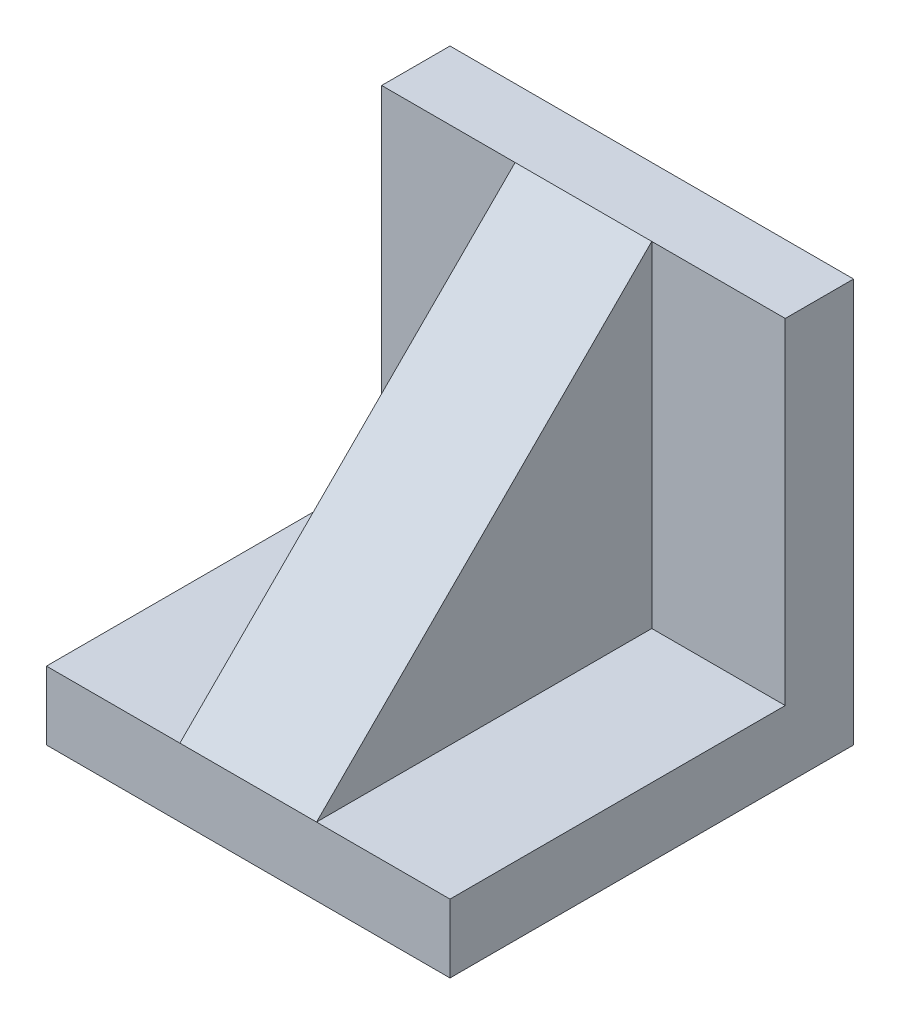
ISO-10303-21;
HEADER;
FILE_DESCRIPTION(('STEP AP214'),'2;1');
FILE_NAME('part.step','',(''),(''),'','','');
FILE_SCHEMA(('AUTOMOTIVE_DESIGN { 1 0 10303 214 1 1 1 1 }'));
ENDSEC;
DATA;
#1=APPLICATION_CONTEXT('core data for automotive mechanical design processes');
#2=APPLICATION_PROTOCOL_DEFINITION('international standard','automotive_design',2000,#1);
#3=PRODUCT_CONTEXT('',#1,'mechanical');
#4=PRODUCT('Part','Part','',(#3));
#5=PRODUCT_RELATED_PRODUCT_CATEGORY('part','',(#4));
#6=PRODUCT_DEFINITION_FORMATION('','',#4);
#7=PRODUCT_DEFINITION_CONTEXT('part definition',#1,'design');
#8=PRODUCT_DEFINITION('design','',#6,#7);
#9=PRODUCT_DEFINITION_SHAPE('','',#8);
#10=(LENGTH_UNIT() NAMED_UNIT(*) SI_UNIT(.MILLI.,.METRE.));
#11=(NAMED_UNIT(*) PLANE_ANGLE_UNIT() SI_UNIT($,.RADIAN.));
#12=(NAMED_UNIT(*) SI_UNIT($,.STERADIAN.) SOLID_ANGLE_UNIT());
#13=UNCERTAINTY_MEASURE_WITH_UNIT(LENGTH_MEASURE(1.E-05),#10,'distance_accuracy_value','');
#14=(GEOMETRIC_REPRESENTATION_CONTEXT(3) GLOBAL_UNCERTAINTY_ASSIGNED_CONTEXT((#13)) GLOBAL_UNIT_ASSIGNED_CONTEXT((#10,
#11,#12)) REPRESENTATION_CONTEXT('',''));
#15=CARTESIAN_POINT('',(0.,0.,0.));
#16=DIRECTION('',(0.,0.,1.));
#17=DIRECTION('',(1.,0.,0.));
#18=AXIS2_PLACEMENT_3D('',#15,#16,#17);
#19=CARTESIAN_POINT('',(-75.,25.4,150.));
#20=DIRECTION('',(0.,-1.,0.));
#21=DIRECTION('',(0.,0.,-1.));
#22=AXIS2_PLACEMENT_3D('',#19,#20,#21);
#23=PLANE('',#22);
#24=DIRECTION('',(0.,0.,-1.));
#25=VECTOR('',#24,1.);
#26=CARTESIAN_POINT('',(25.4,25.4,150.));
#27=LINE('',#26,#25);
#28=CARTESIAN_POINT('',(25.4,25.4,150.));
#29=VERTEX_POINT('',#28);
#30=CARTESIAN_POINT('',(25.4,25.4,25.4));
#31=VERTEX_POINT('',#30);
#32=EDGE_CURVE('E131',#29,#31,#27,.T.);
#33=ORIENTED_EDGE('',*,*,#32,.F.);
#34=DIRECTION('',(1.,0.,0.));
#35=VECTOR('',#34,1.);
#36=CARTESIAN_POINT('',(-75.,25.4,150.));
#37=LINE('',#36,#35);
#38=CARTESIAN_POINT('',(75.,25.4,150.));
#39=VERTEX_POINT('',#38);
#40=EDGE_CURVE('E55',#29,#39,#37,.T.);
#41=ORIENTED_EDGE('',*,*,#40,.T.);
#42=DIRECTION('',(0.,0.,-1.));
#43=VECTOR('',#42,1.);
#44=CARTESIAN_POINT('',(75.,25.4,150.));
#45=LINE('',#44,#43);
#46=CARTESIAN_POINT('',(75.,25.4,25.4));
#47=VERTEX_POINT('',#46);
#48=EDGE_CURVE('E186',#39,#47,#45,.T.);
#49=ORIENTED_EDGE('',*,*,#48,.T.);
#50=DIRECTION('',(1.,0.,0.));
#51=VECTOR('',#50,1.);
#52=CARTESIAN_POINT('',(-75.,25.4,25.4));
#53=LINE('',#52,#51);
#54=EDGE_CURVE('E139',#31,#47,#53,.T.);
#55=ORIENTED_EDGE('',*,*,#54,.F.);
#56=EDGE_LOOP('',(#33,#41,#49,#55));
#57=FACE_BOUND('',#56,.T.);
#58=ADVANCED_FACE('F47',(#57),#23,.F.);
#59=CARTESIAN_POINT('',(-75.,25.4,25.4));
#60=DIRECTION('',(0.,0.,-1.));
#61=DIRECTION('',(-1.,0.,0.));
#62=AXIS2_PLACEMENT_3D('',#59,#60,#61);
#63=PLANE('',#62);
#64=DIRECTION('',(0.,1.,0.));
#65=VECTOR('',#64,1.);
#66=CARTESIAN_POINT('',(25.4,25.4,25.4));
#67=LINE('',#66,#65);
#68=CARTESIAN_POINT('',(25.4,150.,25.4));
#69=VERTEX_POINT('',#68);
#70=EDGE_CURVE('E125',#31,#69,#67,.T.);
#71=ORIENTED_EDGE('',*,*,#70,.F.);
#72=ORIENTED_EDGE('',*,*,#54,.T.);
#73=DIRECTION('',(0.,1.,0.));
#74=VECTOR('',#73,1.);
#75=CARTESIAN_POINT('',(75.,25.4,25.4));
#76=LINE('',#75,#74);
#77=CARTESIAN_POINT('',(75.,150.,25.4));
#78=VERTEX_POINT('',#77);
#79=EDGE_CURVE('E183',#47,#78,#76,.T.);
#80=ORIENTED_EDGE('',*,*,#79,.T.);
#81=DIRECTION('',(1.,0.,0.));
#82=VECTOR('',#81,1.);
#83=CARTESIAN_POINT('',(-75.,150.,25.4));
#84=LINE('',#83,#82);
#85=EDGE_CURVE('E156',#69,#78,#84,.T.);
#86=ORIENTED_EDGE('',*,*,#85,.F.);
#87=EDGE_LOOP('',(#71,#72,#80,#86));
#88=FACE_BOUND('',#87,.T.);
#89=ADVANCED_FACE('F222',(#88),#63,.F.);
#90=CARTESIAN_POINT('',(-75.,0.,150.));
#91=DIRECTION('',(0.,0.,-1.));
#92=DIRECTION('',(-1.,0.,0.));
#93=AXIS2_PLACEMENT_3D('',#90,#91,#92);
#94=PLANE('',#93);
#95=DIRECTION('',(1.,0.,0.));
#96=VECTOR('',#95,1.);
#97=CARTESIAN_POINT('',(-75.,0.,150.));
#98=LINE('',#97,#96);
#99=CARTESIAN_POINT('',(-75.,0.,150.));
#100=VERTEX_POINT('',#99);
#101=CARTESIAN_POINT('',(75.,0.,150.));
#102=VERTEX_POINT('',#101);
#103=EDGE_CURVE('E161',#100,#102,#98,.T.);
#104=ORIENTED_EDGE('',*,*,#103,.T.);
#105=DIRECTION('',(0.,1.,0.));
#106=VECTOR('',#105,1.);
#107=CARTESIAN_POINT('',(75.,0.,150.));
#108=LINE('',#107,#106);
#109=EDGE_CURVE('E145',#102,#39,#108,.T.);
#110=ORIENTED_EDGE('',*,*,#109,.T.);
#111=ORIENTED_EDGE('',*,*,#40,.F.);
#112=DIRECTION('',(1.,0.,0.));
#113=VECTOR('',#112,1.);
#114=CARTESIAN_POINT('',(-25.4,25.4,150.));
#115=LINE('',#114,#113);
#116=CARTESIAN_POINT('',(-25.4,25.4,150.));
#117=VERTEX_POINT('',#116);
#118=EDGE_CURVE('E118',#117,#29,#115,.T.);
#119=ORIENTED_EDGE('',*,*,#118,.F.);
#120=CARTESIAN_POINT('',(-75.,25.4,150.));
#121=VERTEX_POINT('',#120);
#122=EDGE_CURVE('E11',#121,#117,#37,.T.);
#123=ORIENTED_EDGE('',*,*,#122,.F.);
#124=DIRECTION('',(0.,1.,0.));
#125=VECTOR('',#124,1.);
#126=CARTESIAN_POINT('',(-75.,0.,150.));
#127=LINE('',#126,#125);
#128=EDGE_CURVE('E172',#100,#121,#127,.T.);
#129=ORIENTED_EDGE('',*,*,#128,.F.);
#130=EDGE_LOOP('',(#104,#110,#111,#119,#123,#129));
#131=FACE_BOUND('',#130,.T.);
#132=ADVANCED_FACE('F49',(#131),#94,.F.);
#133=ORIENTED_EDGE('',*,*,#122,.T.);
#134=DIRECTION('',(0.,0.,-1.));
#135=VECTOR('',#134,1.);
#136=CARTESIAN_POINT('',(-25.4,25.4,150.));
#137=LINE('',#136,#135);
#138=CARTESIAN_POINT('',(-25.4,25.4,25.4));
#139=VERTEX_POINT('',#138);
#140=EDGE_CURVE('E189',#117,#139,#137,.T.);
#141=ORIENTED_EDGE('',*,*,#140,.T.);
#142=CARTESIAN_POINT('',(-75.,25.4,25.4));
#143=VERTEX_POINT('',#142);
#144=EDGE_CURVE('E146',#143,#139,#53,.T.);
#145=ORIENTED_EDGE('',*,*,#144,.F.);
#146=DIRECTION('',(0.,0.,-1.));
#147=VECTOR('',#146,1.);
#148=CARTESIAN_POINT('',(-75.,25.4,150.));
#149=LINE('',#148,#147);
#150=EDGE_CURVE('E170',#121,#143,#149,.T.);
#151=ORIENTED_EDGE('',*,*,#150,.F.);
#152=EDGE_LOOP('',(#133,#141,#145,#151));
#153=FACE_BOUND('',#152,.T.);
#154=ADVANCED_FACE('F211',(#153),#23,.F.);
#155=ORIENTED_EDGE('',*,*,#144,.T.);
#156=DIRECTION('',(0.,1.,0.));
#157=VECTOR('',#156,1.);
#158=CARTESIAN_POINT('',(-25.4,25.4,25.4));
#159=LINE('',#158,#157);
#160=CARTESIAN_POINT('',(-25.4,150.,25.4));
#161=VERTEX_POINT('',#160);
#162=EDGE_CURVE('E141',#139,#161,#159,.T.);
#163=ORIENTED_EDGE('',*,*,#162,.T.);
#164=CARTESIAN_POINT('',(-75.,150.,25.4));
#165=VERTEX_POINT('',#164);
#166=EDGE_CURVE('E152',#165,#161,#84,.T.);
#167=ORIENTED_EDGE('',*,*,#166,.F.);
#168=DIRECTION('',(0.,1.,0.));
#169=VECTOR('',#168,1.);
#170=CARTESIAN_POINT('',(-75.,25.4,25.4));
#171=LINE('',#170,#169);
#172=EDGE_CURVE('E168',#143,#165,#171,.T.);
#173=ORIENTED_EDGE('',*,*,#172,.F.);
#174=EDGE_LOOP('',(#155,#163,#167,#173));
#175=FACE_BOUND('',#174,.T.);
#176=ADVANCED_FACE('F204',(#175),#63,.F.);
#177=CARTESIAN_POINT('',(-75.,150.,25.4));
#178=DIRECTION('',(0.,-1.,0.));
#179=DIRECTION('',(0.,0.,-1.));
#180=AXIS2_PLACEMENT_3D('',#177,#178,#179);
#181=PLANE('',#180);
#182=ORIENTED_EDGE('',*,*,#166,.T.);
#183=DIRECTION('',(1.,0.,0.));
#184=VECTOR('',#183,1.);
#185=CARTESIAN_POINT('',(-25.4,150.,25.4));
#186=LINE('',#185,#184);
#187=EDGE_CURVE('E126',#161,#69,#186,.T.);
#188=ORIENTED_EDGE('',*,*,#187,.T.);
#189=ORIENTED_EDGE('',*,*,#85,.T.);
#190=DIRECTION('',(0.,0.,-1.));
#191=VECTOR('',#190,1.);
#192=CARTESIAN_POINT('',(75.,150.,25.4));
#193=LINE('',#192,#191);
#194=CARTESIAN_POINT('',(75.,150.,0.));
#195=VERTEX_POINT('',#194);
#196=EDGE_CURVE('E180',#78,#195,#193,.T.);
#197=ORIENTED_EDGE('',*,*,#196,.T.);
#198=DIRECTION('',(1.,0.,0.));
#199=VECTOR('',#198,1.);
#200=CARTESIAN_POINT('',(-75.,150.,0.));
#201=LINE('',#200,#199);
#202=CARTESIAN_POINT('',(-75.,150.,0.));
#203=VERTEX_POINT('',#202);
#204=EDGE_CURVE('E157',#203,#195,#201,.T.);
#205=ORIENTED_EDGE('',*,*,#204,.F.);
#206=DIRECTION('',(0.,0.,-1.));
#207=VECTOR('',#206,1.);
#208=CARTESIAN_POINT('',(-75.,150.,25.4));
#209=LINE('',#208,#207);
#210=EDGE_CURVE('E166',#165,#203,#209,.T.);
#211=ORIENTED_EDGE('',*,*,#210,.F.);
#212=EDGE_LOOP('',(#182,#188,#189,#197,#205,#211));
#213=FACE_BOUND('',#212,.T.);
#214=ADVANCED_FACE('F198',(#213),#181,.F.);
#215=CARTESIAN_POINT('',(-75.,150.,0.));
#216=DIRECTION('',(0.,0.,1.));
#217=DIRECTION('',(0.,-1.,0.));
#218=AXIS2_PLACEMENT_3D('',#215,#216,#217);
#219=PLANE('',#218);
#220=ORIENTED_EDGE('',*,*,#204,.T.);
#221=DIRECTION('',(0.,-1.,0.));
#222=VECTOR('',#221,1.);
#223=CARTESIAN_POINT('',(75.,150.,0.));
#224=LINE('',#223,#222);
#225=CARTESIAN_POINT('',(75.,0.,0.));
#226=VERTEX_POINT('',#225);
#227=EDGE_CURVE('E177',#195,#226,#224,.T.);
#228=ORIENTED_EDGE('',*,*,#227,.T.);
#229=DIRECTION('',(1.,0.,0.));
#230=VECTOR('',#229,1.);
#231=CARTESIAN_POINT('',(-75.,0.,0.));
#232=LINE('',#231,#230);
#233=CARTESIAN_POINT('',(-75.,0.,0.));
#234=VERTEX_POINT('',#233);
#235=EDGE_CURVE('E159',#234,#226,#232,.T.);
#236=ORIENTED_EDGE('',*,*,#235,.F.);
#237=DIRECTION('',(0.,-1.,0.));
#238=VECTOR('',#237,1.);
#239=CARTESIAN_POINT('',(-75.,150.,0.));
#240=LINE('',#239,#238);
#241=EDGE_CURVE('E164',#203,#234,#240,.T.);
#242=ORIENTED_EDGE('',*,*,#241,.F.);
#243=EDGE_LOOP('',(#220,#228,#236,#242));
#244=FACE_BOUND('',#243,.T.);
#245=ADVANCED_FACE('F220',(#244),#219,.F.);
#246=CARTESIAN_POINT('',(-75.,0.,0.));
#247=DIRECTION('',(0.,1.,0.));
#248=DIRECTION('',(0.,0.,1.));
#249=AXIS2_PLACEMENT_3D('',#246,#247,#248);
#250=PLANE('',#249);
#251=ORIENTED_EDGE('',*,*,#235,.T.);
#252=DIRECTION('',(0.,0.,1.));
#253=VECTOR('',#252,1.);
#254=CARTESIAN_POINT('',(75.,0.,0.));
#255=LINE('',#254,#253);
#256=EDGE_CURVE('E174',#226,#102,#255,.T.);
#257=ORIENTED_EDGE('',*,*,#256,.T.);
#258=ORIENTED_EDGE('',*,*,#103,.F.);
#259=DIRECTION('',(0.,0.,1.));
#260=VECTOR('',#259,1.);
#261=CARTESIAN_POINT('',(-75.,0.,0.));
#262=LINE('',#261,#260);
#263=EDGE_CURVE('E70',#234,#100,#262,.T.);
#264=ORIENTED_EDGE('',*,*,#263,.F.);
#265=EDGE_LOOP('',(#251,#257,#258,#264));
#266=FACE_BOUND('',#265,.T.);
#267=ADVANCED_FACE('F218',(#266),#250,.F.);
#268=CARTESIAN_POINT('',(-75.,0.,0.));
#269=DIRECTION('',(-1.,0.,0.));
#270=DIRECTION('',(0.,0.,1.));
#271=AXIS2_PLACEMENT_3D('',#268,#269,#270);
#272=PLANE('',#271);
#273=ORIENTED_EDGE('',*,*,#128,.T.);
#274=ORIENTED_EDGE('',*,*,#150,.T.);
#275=ORIENTED_EDGE('',*,*,#172,.T.);
#276=ORIENTED_EDGE('',*,*,#210,.T.);
#277=ORIENTED_EDGE('',*,*,#241,.T.);
#278=ORIENTED_EDGE('',*,*,#263,.T.);
#279=EDGE_LOOP('',(#273,#274,#275,#276,#277,#278));
#280=FACE_BOUND('',#279,.T.);
#281=ADVANCED_FACE('F207',(#280),#272,.T.);
#282=CARTESIAN_POINT('',(75.,0.,0.));
#283=DIRECTION('',(-1.,0.,0.));
#284=DIRECTION('',(0.,0.,1.));
#285=AXIS2_PLACEMENT_3D('',#282,#283,#284);
#286=PLANE('',#285);
#287=ORIENTED_EDGE('',*,*,#109,.F.);
#288=ORIENTED_EDGE('',*,*,#256,.F.);
#289=ORIENTED_EDGE('',*,*,#227,.F.);
#290=ORIENTED_EDGE('',*,*,#196,.F.);
#291=ORIENTED_EDGE('',*,*,#79,.F.);
#292=ORIENTED_EDGE('',*,*,#48,.F.);
#293=EDGE_LOOP('',(#287,#288,#289,#290,#291,#292));
#294=FACE_BOUND('',#293,.T.);
#295=ADVANCED_FACE('F215',(#294),#286,.F.);
#296=CARTESIAN_POINT('',(-25.4,0.,0.));
#297=DIRECTION('',(-1.,0.,0.));
#298=DIRECTION('',(0.,0.,1.));
#299=AXIS2_PLACEMENT_3D('',#296,#297,#298);
#300=PLANE('',#299);
#301=ORIENTED_EDGE('',*,*,#140,.F.);
#302=DIRECTION('',(0.,-0.707106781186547,0.707106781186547));
#303=VECTOR('',#302,1.);
#304=CARTESIAN_POINT('',(-25.4,25.4,150.));
#305=LINE('',#304,#303);
#306=EDGE_CURVE('E121',#161,#117,#305,.T.);
#307=ORIENTED_EDGE('',*,*,#306,.F.);
#308=ORIENTED_EDGE('',*,*,#162,.F.);
#309=EDGE_LOOP('',(#301,#307,#308));
#310=FACE_BOUND('',#309,.T.);
#311=ADVANCED_FACE('F203',(#310),#300,.T.);
#312=CARTESIAN_POINT('',(25.4,0.,0.));
#313=DIRECTION('',(-1.,0.,0.));
#314=DIRECTION('',(0.,0.,1.));
#315=AXIS2_PLACEMENT_3D('',#312,#313,#314);
#316=PLANE('',#315);
#317=DIRECTION('',(0.,-0.707106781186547,0.707106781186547));
#318=VECTOR('',#317,1.);
#319=CARTESIAN_POINT('',(25.4,25.4,150.));
#320=LINE('',#319,#318);
#321=EDGE_CURVE('E62',#69,#29,#320,.T.);
#322=ORIENTED_EDGE('',*,*,#321,.T.);
#323=ORIENTED_EDGE('',*,*,#32,.T.);
#324=ORIENTED_EDGE('',*,*,#70,.T.);
#325=EDGE_LOOP('',(#322,#323,#324));
#326=FACE_BOUND('',#325,.T.);
#327=ADVANCED_FACE('F130',(#326),#316,.F.);
#328=CARTESIAN_POINT('',(-25.4,25.4,150.));
#329=DIRECTION('',(0.,0.707106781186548,0.707106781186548));
#330=DIRECTION('',(0.,-0.707106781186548,0.707106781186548));
#331=AXIS2_PLACEMENT_3D('',#328,#329,#330);
#332=PLANE('',#331);
#333=ORIENTED_EDGE('',*,*,#118,.T.);
#334=ORIENTED_EDGE('',*,*,#321,.F.);
#335=ORIENTED_EDGE('',*,*,#187,.F.);
#336=ORIENTED_EDGE('',*,*,#306,.T.);
#337=EDGE_LOOP('',(#333,#334,#335,#336));
#338=FACE_BOUND('',#337,.T.);
#339=ADVANCED_FACE('F119',(#338),#332,.T.);
#340=CLOSED_SHELL('',(#58,#89,#132,#154,#176,#214,#245,#267,#281,#295,#311,#327,#339));
#341=MANIFOLD_SOLID_BREP('B2',#340);
#342=ADVANCED_BREP_SHAPE_REPRESENTATION('',(#18,#341),#14);
#343=SHAPE_DEFINITION_REPRESENTATION(#9,#342);
ENDSEC;
END-ISO-10303-21;
